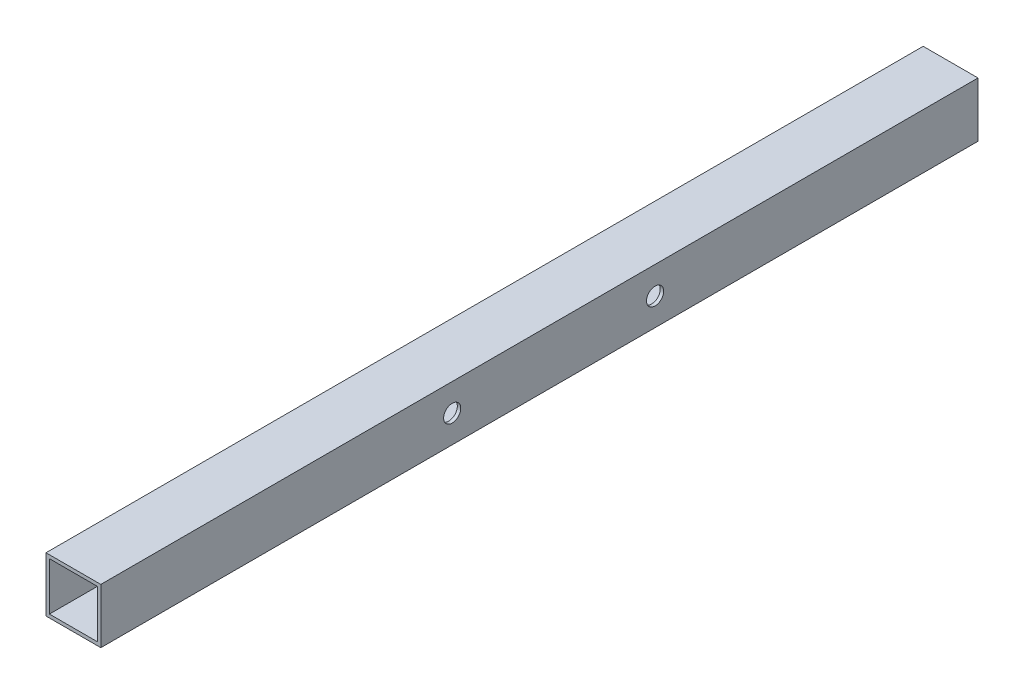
ISO-10303-21;
HEADER;
FILE_DESCRIPTION(('STEP AP214'),'2;1');
FILE_NAME('part.step','',(''),(''),'','','');
FILE_SCHEMA(('AUTOMOTIVE_DESIGN { 1 0 10303 214 1 1 1 1 }'));
ENDSEC;
DATA;
#1=APPLICATION_CONTEXT('core data for automotive mechanical design processes');
#2=APPLICATION_PROTOCOL_DEFINITION('international standard','automotive_design',2000,#1);
#3=PRODUCT_CONTEXT('',#1,'mechanical');
#4=PRODUCT('Part','Part','',(#3));
#5=PRODUCT_RELATED_PRODUCT_CATEGORY('part','',(#4));
#6=PRODUCT_DEFINITION_FORMATION('','',#4);
#7=PRODUCT_DEFINITION_CONTEXT('part definition',#1,'design');
#8=PRODUCT_DEFINITION('design','',#6,#7);
#9=PRODUCT_DEFINITION_SHAPE('','',#8);
#10=(LENGTH_UNIT() NAMED_UNIT(*) SI_UNIT(.MILLI.,.METRE.));
#11=(NAMED_UNIT(*) PLANE_ANGLE_UNIT() SI_UNIT($,.RADIAN.));
#12=(NAMED_UNIT(*) SI_UNIT($,.STERADIAN.) SOLID_ANGLE_UNIT());
#13=UNCERTAINTY_MEASURE_WITH_UNIT(LENGTH_MEASURE(1.E-05),#10,'distance_accuracy_value','');
#14=(GEOMETRIC_REPRESENTATION_CONTEXT(3) GLOBAL_UNCERTAINTY_ASSIGNED_CONTEXT((#13)) GLOBAL_UNIT_ASSIGNED_CONTEXT((#10,
#11,#12)) REPRESENTATION_CONTEXT('',''));
#15=CARTESIAN_POINT('',(0.,0.,0.));
#16=DIRECTION('',(0.,0.,1.));
#17=DIRECTION('',(1.,0.,0.));
#18=AXIS2_PLACEMENT_3D('',#15,#16,#17);
#19=CARTESIAN_POINT('',(-25.4000000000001,-25.4000000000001,-812.8));
#20=DIRECTION('',(-1.00000000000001,0.,0.));
#21=DIRECTION('',(0.,0.,1.));
#22=AXIS2_PLACEMENT_3D('',#19,#20,#21);
#23=PLANE('',#22);
#24=CARTESIAN_POINT('',(-25.4000000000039,0.,-513.588));
#25=DIRECTION('',(1.00000000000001,0.,0.));
#26=DIRECTION('',(0.,1.,0.));
#27=AXIS2_PLACEMENT_3D('',#24,#25,#26);
#28=CIRCLE('',#27,7.93750000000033);
#29=CARTESIAN_POINT('',(-25.4000000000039,7.93750000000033,-513.588));
#30=VERTEX_POINT('',#29);
#31=EDGE_CURVE('E197',#30,#30,#28,.T.);
#32=ORIENTED_EDGE('',*,*,#31,.T.);
#33=EDGE_LOOP('',(#32));
#34=FACE_BOUND('',#33,.T.);
#35=CARTESIAN_POINT('',(-25.4000000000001,0.,-325.5772));
#36=DIRECTION('',(1.00000000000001,0.,0.));
#37=DIRECTION('',(0.,1.,0.));
#38=AXIS2_PLACEMENT_3D('',#35,#36,#37);
#39=CIRCLE('',#38,7.93750000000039);
#40=CARTESIAN_POINT('',(-25.4000000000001,7.93750000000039,-325.5772));
#41=VERTEX_POINT('',#40);
#42=EDGE_CURVE('E180',#41,#41,#39,.T.);
#43=ORIENTED_EDGE('',*,*,#42,.T.);
#44=EDGE_LOOP('',(#43));
#45=FACE_BOUND('',#44,.T.);
#46=DIRECTION('',(0.,-1.,0.));
#47=VECTOR('',#46,1.);
#48=CARTESIAN_POINT('',(-25.4000000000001,-25.4000000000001,0.));
#49=LINE('',#48,#47);
#50=CARTESIAN_POINT('',(-25.4000000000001,25.4000000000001,0.));
#51=VERTEX_POINT('',#50);
#52=CARTESIAN_POINT('',(-25.4000000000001,-25.4000000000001,0.));
#53=VERTEX_POINT('',#52);
#54=EDGE_CURVE('E147',#51,#53,#49,.T.);
#55=ORIENTED_EDGE('',*,*,#54,.F.);
#56=DIRECTION('',(0.,0.,1.));
#57=VECTOR('',#56,1.);
#58=CARTESIAN_POINT('',(-25.4000000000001,25.3999999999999,-812.8));
#59=LINE('',#58,#57);
#60=CARTESIAN_POINT('',(-25.4000000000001,25.3999999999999,-812.8));
#61=VERTEX_POINT('',#60);
#62=EDGE_CURVE('E13',#61,#51,#59,.T.);
#63=ORIENTED_EDGE('',*,*,#62,.F.);
#64=DIRECTION('',(0.,-1.,0.));
#65=VECTOR('',#64,1.);
#66=CARTESIAN_POINT('',(-25.4000000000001,-25.4000000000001,-812.8));
#67=LINE('',#66,#65);
#68=CARTESIAN_POINT('',(-25.4000000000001,-25.4000000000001,-812.8));
#69=VERTEX_POINT('',#68);
#70=EDGE_CURVE('E151',#61,#69,#67,.T.);
#71=ORIENTED_EDGE('',*,*,#70,.T.);
#72=DIRECTION('',(0.,0.,1.));
#73=VECTOR('',#72,1.);
#74=CARTESIAN_POINT('',(-25.4000000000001,-25.4000000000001,-812.8));
#75=LINE('',#74,#73);
#76=EDGE_CURVE('E164',#69,#53,#75,.T.);
#77=ORIENTED_EDGE('',*,*,#76,.T.);
#78=EDGE_LOOP('',(#55,#63,#71,#77));
#79=FACE_BOUND('',#78,.T.);
#80=ADVANCED_FACE('F46',(#34,#45,#79),#23,.T.);
#81=CARTESIAN_POINT('',(-25.4000000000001,25.3999999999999,-812.8));
#82=DIRECTION('',(0.,1.,0.));
#83=DIRECTION('',(0.,0.,1.));
#84=AXIS2_PLACEMENT_3D('',#81,#82,#83);
#85=PLANE('',#84);
#86=DIRECTION('',(-1.00000000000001,0.,0.));
#87=VECTOR('',#86,1.);
#88=CARTESIAN_POINT('',(-25.4000000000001,25.4000000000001,0.));
#89=LINE('',#88,#87);
#90=CARTESIAN_POINT('',(25.4000000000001,25.4000000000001,-9.99200722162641E-13));
#91=VERTEX_POINT('',#90);
#92=EDGE_CURVE('E155',#91,#51,#89,.T.);
#93=ORIENTED_EDGE('',*,*,#92,.F.);
#94=DIRECTION('',(0.,0.,1.));
#95=VECTOR('',#94,1.);
#96=CARTESIAN_POINT('',(25.3999999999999,25.3999999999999,-812.800000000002));
#97=LINE('',#96,#95);
#98=CARTESIAN_POINT('',(25.3999999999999,25.3999999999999,-812.800000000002));
#99=VERTEX_POINT('',#98);
#100=EDGE_CURVE('E54',#99,#91,#97,.T.);
#101=ORIENTED_EDGE('',*,*,#100,.F.);
#102=DIRECTION('',(-1.00000000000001,0.,0.));
#103=VECTOR('',#102,1.);
#104=CARTESIAN_POINT('',(-25.4000000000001,25.3999999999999,-812.8));
#105=LINE('',#104,#103);
#106=EDGE_CURVE('E161',#99,#61,#105,.T.);
#107=ORIENTED_EDGE('',*,*,#106,.T.);
#108=ORIENTED_EDGE('',*,*,#62,.T.);
#109=EDGE_LOOP('',(#93,#101,#107,#108));
#110=FACE_BOUND('',#109,.T.);
#111=ADVANCED_FACE('F220',(#110),#85,.T.);
#112=CARTESIAN_POINT('',(25.3999999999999,-25.4000000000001,-812.8));
#113=DIRECTION('',(1.00000000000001,0.,0.));
#114=DIRECTION('',(0.,1.,0.));
#115=AXIS2_PLACEMENT_3D('',#112,#113,#114);
#116=PLANE('',#115);
#117=CARTESIAN_POINT('',(25.3999999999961,0.,-513.588));
#118=DIRECTION('',(1.00000000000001,0.,0.));
#119=DIRECTION('',(0.,1.,0.));
#120=AXIS2_PLACEMENT_3D('',#117,#118,#119);
#121=CIRCLE('',#120,7.93750000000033);
#122=CARTESIAN_POINT('',(25.3999999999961,7.93750000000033,-513.588));
#123=VERTEX_POINT('',#122);
#124=EDGE_CURVE('E194',#123,#123,#121,.T.);
#125=ORIENTED_EDGE('',*,*,#124,.F.);
#126=EDGE_LOOP('',(#125));
#127=FACE_BOUND('',#126,.T.);
#128=CARTESIAN_POINT('',(25.3999999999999,0.,-325.5772));
#129=DIRECTION('',(1.00000000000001,0.,0.));
#130=DIRECTION('',(0.,1.,0.));
#131=AXIS2_PLACEMENT_3D('',#128,#129,#130);
#132=CIRCLE('',#131,7.93750000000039);
#133=CARTESIAN_POINT('',(25.3999999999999,7.93750000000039,-325.5772));
#134=VERTEX_POINT('',#133);
#135=EDGE_CURVE('E185',#134,#134,#132,.T.);
#136=ORIENTED_EDGE('',*,*,#135,.F.);
#137=EDGE_LOOP('',(#136));
#138=FACE_BOUND('',#137,.T.);
#139=DIRECTION('',(0.,1.,0.));
#140=VECTOR('',#139,1.);
#141=CARTESIAN_POINT('',(25.4000000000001,-25.4000000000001,-9.99200722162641E-13));
#142=LINE('',#141,#140);
#143=CARTESIAN_POINT('',(25.4000000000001,-25.4000000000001,-9.99200722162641E-13));
#144=VERTEX_POINT('',#143);
#145=EDGE_CURVE('E170',#144,#91,#142,.T.);
#146=ORIENTED_EDGE('',*,*,#145,.F.);
#147=DIRECTION('',(0.,0.,1.));
#148=VECTOR('',#147,1.);
#149=CARTESIAN_POINT('',(25.3999999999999,-25.4000000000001,-812.8));
#150=LINE('',#149,#148);
#151=CARTESIAN_POINT('',(25.3999999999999,-25.4000000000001,-812.8));
#152=VERTEX_POINT('',#151);
#153=EDGE_CURVE('E176',#152,#144,#150,.T.);
#154=ORIENTED_EDGE('',*,*,#153,.F.);
#155=DIRECTION('',(0.,1.,0.));
#156=VECTOR('',#155,1.);
#157=CARTESIAN_POINT('',(25.3999999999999,-25.4000000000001,-812.8));
#158=LINE('',#157,#156);
#159=EDGE_CURVE('E158',#152,#99,#158,.T.);
#160=ORIENTED_EDGE('',*,*,#159,.T.);
#161=ORIENTED_EDGE('',*,*,#100,.T.);
#162=EDGE_LOOP('',(#146,#154,#160,#161));
#163=FACE_BOUND('',#162,.T.);
#164=ADVANCED_FACE('F224',(#127,#138,#163),#116,.T.);
#165=CARTESIAN_POINT('',(-25.4000000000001,-25.4000000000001,-812.8));
#166=DIRECTION('',(0.,-1.,0.));
#167=DIRECTION('',(0.,0.,-1.));
#168=AXIS2_PLACEMENT_3D('',#165,#166,#167);
#169=PLANE('',#168);
#170=DIRECTION('',(1.00000000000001,0.,0.));
#171=VECTOR('',#170,1.);
#172=CARTESIAN_POINT('',(-25.4000000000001,-25.4000000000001,0.));
#173=LINE('',#172,#171);
#174=EDGE_CURVE('E167',#53,#144,#173,.T.);
#175=ORIENTED_EDGE('',*,*,#174,.F.);
#176=ORIENTED_EDGE('',*,*,#76,.F.);
#177=DIRECTION('',(1.00000000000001,0.,0.));
#178=VECTOR('',#177,1.);
#179=CARTESIAN_POINT('',(-25.4000000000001,-25.4000000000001,-812.8));
#180=LINE('',#179,#178);
#181=EDGE_CURVE('E154',#69,#152,#180,.T.);
#182=ORIENTED_EDGE('',*,*,#181,.T.);
#183=ORIENTED_EDGE('',*,*,#153,.T.);
#184=EDGE_LOOP('',(#175,#176,#182,#183));
#185=FACE_BOUND('',#184,.T.);
#186=ADVANCED_FACE('F239',(#185),#169,.T.);
#187=CARTESIAN_POINT('',(0.,0.,-812.8));
#188=DIRECTION('',(0.,0.,-1.));
#189=DIRECTION('',(-1.00000000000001,0.,0.));
#190=AXIS2_PLACEMENT_3D('',#187,#188,#189);
#191=PLANE('',#190);
#192=DIRECTION('',(1.00000000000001,0.,0.));
#193=VECTOR('',#192,1.);
#194=CARTESIAN_POINT('',(-22.2249999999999,-22.2249999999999,-812.8));
#195=LINE('',#194,#193);
#196=CARTESIAN_POINT('',(-22.2249999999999,-22.2249999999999,-812.8));
#197=VERTEX_POINT('',#196);
#198=CARTESIAN_POINT('',(22.2249999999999,-22.2249999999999,-812.8));
#199=VERTEX_POINT('',#198);
#200=EDGE_CURVE('E113',#197,#199,#195,.T.);
#201=ORIENTED_EDGE('',*,*,#200,.T.);
#202=DIRECTION('',(0.,1.,0.));
#203=VECTOR('',#202,1.);
#204=CARTESIAN_POINT('',(22.2249999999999,-22.2249999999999,-812.8));
#205=LINE('',#204,#203);
#206=CARTESIAN_POINT('',(22.2249999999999,22.2249999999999,-812.8));
#207=VERTEX_POINT('',#206);
#208=EDGE_CURVE('E122',#199,#207,#205,.T.);
#209=ORIENTED_EDGE('',*,*,#208,.T.);
#210=DIRECTION('',(-1.00000000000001,0.,0.));
#211=VECTOR('',#210,1.);
#212=CARTESIAN_POINT('',(-22.2249999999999,22.2249999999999,-812.8));
#213=LINE('',#212,#211);
#214=CARTESIAN_POINT('',(-22.2249999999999,22.2249999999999,-812.8));
#215=VERTEX_POINT('',#214);
#216=EDGE_CURVE('E62',#207,#215,#213,.T.);
#217=ORIENTED_EDGE('',*,*,#216,.T.);
#218=DIRECTION('',(0.,-1.,0.));
#219=VECTOR('',#218,1.);
#220=CARTESIAN_POINT('',(-22.2249999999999,-22.2249999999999,-812.8));
#221=LINE('',#220,#219);
#222=EDGE_CURVE('E119',#215,#197,#221,.T.);
#223=ORIENTED_EDGE('',*,*,#222,.T.);
#224=EDGE_LOOP('',(#201,#209,#217,#223));
#225=FACE_BOUND('',#224,.T.);
#226=ORIENTED_EDGE('',*,*,#70,.F.);
#227=ORIENTED_EDGE('',*,*,#106,.F.);
#228=ORIENTED_EDGE('',*,*,#159,.F.);
#229=ORIENTED_EDGE('',*,*,#181,.F.);
#230=EDGE_LOOP('',(#226,#227,#228,#229));
#231=FACE_BOUND('',#230,.T.);
#232=ADVANCED_FACE('F126',(#225,#231),#191,.T.);
#233=CARTESIAN_POINT('',(0.,0.,0.));
#234=DIRECTION('',(0.,0.,-1.));
#235=DIRECTION('',(-1.00000000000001,0.,0.));
#236=AXIS2_PLACEMENT_3D('',#233,#234,#235);
#237=PLANE('',#236);
#238=DIRECTION('',(0.,1.,0.));
#239=VECTOR('',#238,1.);
#240=CARTESIAN_POINT('',(22.2249999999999,-22.2249999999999,0.));
#241=LINE('',#240,#239);
#242=CARTESIAN_POINT('',(22.2249999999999,-22.2249999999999,0.));
#243=VERTEX_POINT('',#242);
#244=CARTESIAN_POINT('',(22.2249999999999,22.2249999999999,0.));
#245=VERTEX_POINT('',#244);
#246=EDGE_CURVE('E141',#243,#245,#241,.T.);
#247=ORIENTED_EDGE('',*,*,#246,.F.);
#248=DIRECTION('',(1.00000000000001,0.,0.));
#249=VECTOR('',#248,1.);
#250=CARTESIAN_POINT('',(-22.2249999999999,-22.2249999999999,0.));
#251=LINE('',#250,#249);
#252=CARTESIAN_POINT('',(-22.2249999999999,-22.2249999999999,0.));
#253=VERTEX_POINT('',#252);
#254=EDGE_CURVE('E70',#253,#243,#251,.T.);
#255=ORIENTED_EDGE('',*,*,#254,.F.);
#256=DIRECTION('',(0.,-1.,0.));
#257=VECTOR('',#256,1.);
#258=CARTESIAN_POINT('',(-22.2249999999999,-22.2249999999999,0.));
#259=LINE('',#258,#257);
#260=CARTESIAN_POINT('',(-22.2249999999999,22.2249999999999,0.));
#261=VERTEX_POINT('',#260);
#262=EDGE_CURVE('E129',#261,#253,#259,.T.);
#263=ORIENTED_EDGE('',*,*,#262,.F.);
#264=DIRECTION('',(-1.00000000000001,0.,0.));
#265=VECTOR('',#264,1.);
#266=CARTESIAN_POINT('',(-22.2249999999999,22.2249999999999,0.));
#267=LINE('',#266,#265);
#268=EDGE_CURVE('E132',#245,#261,#267,.T.);
#269=ORIENTED_EDGE('',*,*,#268,.F.);
#270=EDGE_LOOP('',(#247,#255,#263,#269));
#271=FACE_BOUND('',#270,.T.);
#272=ORIENTED_EDGE('',*,*,#54,.T.);
#273=ORIENTED_EDGE('',*,*,#174,.T.);
#274=ORIENTED_EDGE('',*,*,#145,.T.);
#275=ORIENTED_EDGE('',*,*,#92,.T.);
#276=EDGE_LOOP('',(#272,#273,#274,#275));
#277=FACE_BOUND('',#276,.T.);
#278=ADVANCED_FACE('F233',(#271,#277),#237,.F.);
#279=CARTESIAN_POINT('',(-22.2249999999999,-22.2249999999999,-812.8));
#280=DIRECTION('',(0.,-1.,0.));
#281=DIRECTION('',(0.,0.,-1.));
#282=AXIS2_PLACEMENT_3D('',#279,#280,#281);
#283=PLANE('',#282);
#284=ORIENTED_EDGE('',*,*,#254,.T.);
#285=DIRECTION('',(0.,0.,1.));
#286=VECTOR('',#285,1.);
#287=CARTESIAN_POINT('',(22.2249999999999,-22.2249999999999,-812.8));
#288=LINE('',#287,#286);
#289=EDGE_CURVE('E109',#199,#243,#288,.T.);
#290=ORIENTED_EDGE('',*,*,#289,.F.);
#291=ORIENTED_EDGE('',*,*,#200,.F.);
#292=DIRECTION('',(0.,0.,1.));
#293=VECTOR('',#292,1.);
#294=CARTESIAN_POINT('',(-22.2249999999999,-22.2249999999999,-812.8));
#295=LINE('',#294,#293);
#296=EDGE_CURVE('E145',#197,#253,#295,.T.);
#297=ORIENTED_EDGE('',*,*,#296,.T.);
#298=EDGE_LOOP('',(#284,#290,#291,#297));
#299=FACE_BOUND('',#298,.T.);
#300=ADVANCED_FACE('F111',(#299),#283,.F.);
#301=CARTESIAN_POINT('',(-22.2249999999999,-22.2249999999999,-812.8));
#302=DIRECTION('',(-1.00000000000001,0.,0.));
#303=DIRECTION('',(0.,0.,1.));
#304=AXIS2_PLACEMENT_3D('',#301,#302,#303);
#305=PLANE('',#304);
#306=CARTESIAN_POINT('',(-22.2250000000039,0.,-513.588));
#307=DIRECTION('',(-1.00000000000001,0.,0.));
#308=DIRECTION('',(0.,0.,1.));
#309=AXIS2_PLACEMENT_3D('',#306,#307,#308);
#310=CIRCLE('',#309,7.93750000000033);
#311=CARTESIAN_POINT('',(-22.2250000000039,0.,-505.6505));
#312=VERTEX_POINT('',#311);
#313=EDGE_CURVE('E190',#312,#312,#310,.T.);
#314=ORIENTED_EDGE('',*,*,#313,.T.);
#315=EDGE_LOOP('',(#314));
#316=FACE_BOUND('',#315,.T.);
#317=CARTESIAN_POINT('',(-22.2250000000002,0.,-325.5772));
#318=DIRECTION('',(-1.00000000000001,0.,0.));
#319=DIRECTION('',(0.,0.,1.));
#320=AXIS2_PLACEMENT_3D('',#317,#318,#319);
#321=CIRCLE('',#320,7.93750000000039);
#322=CARTESIAN_POINT('',(-22.2250000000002,0.,-317.6397));
#323=VERTEX_POINT('',#322);
#324=EDGE_CURVE('E135',#323,#323,#321,.T.);
#325=ORIENTED_EDGE('',*,*,#324,.T.);
#326=EDGE_LOOP('',(#325));
#327=FACE_BOUND('',#326,.T.);
#328=ORIENTED_EDGE('',*,*,#262,.T.);
#329=ORIENTED_EDGE('',*,*,#296,.F.);
#330=ORIENTED_EDGE('',*,*,#222,.F.);
#331=DIRECTION('',(0.,0.,1.));
#332=VECTOR('',#331,1.);
#333=CARTESIAN_POINT('',(-22.2249999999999,22.2249999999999,-812.8));
#334=LINE('',#333,#332);
#335=EDGE_CURVE('E148',#215,#261,#334,.T.);
#336=ORIENTED_EDGE('',*,*,#335,.T.);
#337=EDGE_LOOP('',(#328,#329,#330,#336));
#338=FACE_BOUND('',#337,.T.);
#339=ADVANCED_FACE('F257',(#316,#327,#338),#305,.F.);
#340=CARTESIAN_POINT('',(-22.2249999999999,22.2249999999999,-812.8));
#341=DIRECTION('',(0.,1.,0.));
#342=DIRECTION('',(-1.00000000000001,0.,0.));
#343=AXIS2_PLACEMENT_3D('',#340,#341,#342);
#344=PLANE('',#343);
#345=ORIENTED_EDGE('',*,*,#268,.T.);
#346=ORIENTED_EDGE('',*,*,#335,.F.);
#347=ORIENTED_EDGE('',*,*,#216,.F.);
#348=DIRECTION('',(0.,0.,1.));
#349=VECTOR('',#348,1.);
#350=CARTESIAN_POINT('',(22.2249999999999,22.2249999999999,-812.8));
#351=LINE('',#350,#349);
#352=EDGE_CURVE('E118',#207,#245,#351,.T.);
#353=ORIENTED_EDGE('',*,*,#352,.T.);
#354=EDGE_LOOP('',(#345,#346,#347,#353));
#355=FACE_BOUND('',#354,.T.);
#356=ADVANCED_FACE('F260',(#355),#344,.F.);
#357=CARTESIAN_POINT('',(22.2249999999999,-22.2249999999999,-812.8));
#358=DIRECTION('',(1.00000000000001,0.,0.));
#359=DIRECTION('',(0.,0.,-1.));
#360=AXIS2_PLACEMENT_3D('',#357,#358,#359);
#361=PLANE('',#360);
#362=CARTESIAN_POINT('',(22.2249999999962,0.,-513.588));
#363=DIRECTION('',(1.00000000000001,0.,0.));
#364=DIRECTION('',(0.,0.,-1.));
#365=AXIS2_PLACEMENT_3D('',#362,#363,#364);
#366=CIRCLE('',#365,7.93750000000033);
#367=CARTESIAN_POINT('',(22.2249999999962,0.,-521.5255));
#368=VERTEX_POINT('',#367);
#369=EDGE_CURVE('E49',#368,#368,#366,.T.);
#370=ORIENTED_EDGE('',*,*,#369,.T.);
#371=EDGE_LOOP('',(#370));
#372=FACE_BOUND('',#371,.T.);
#373=CARTESIAN_POINT('',(22.2249999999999,0.,-325.5772));
#374=DIRECTION('',(1.00000000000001,0.,0.));
#375=DIRECTION('',(0.,0.,-1.));
#376=AXIS2_PLACEMENT_3D('',#373,#374,#375);
#377=CIRCLE('',#376,7.93750000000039);
#378=CARTESIAN_POINT('',(22.2249999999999,0.,-333.5147));
#379=VERTEX_POINT('',#378);
#380=EDGE_CURVE('E178',#379,#379,#377,.T.);
#381=ORIENTED_EDGE('',*,*,#380,.T.);
#382=EDGE_LOOP('',(#381));
#383=FACE_BOUND('',#382,.T.);
#384=ORIENTED_EDGE('',*,*,#246,.T.);
#385=ORIENTED_EDGE('',*,*,#352,.F.);
#386=ORIENTED_EDGE('',*,*,#208,.F.);
#387=ORIENTED_EDGE('',*,*,#289,.T.);
#388=EDGE_LOOP('',(#384,#385,#386,#387));
#389=FACE_BOUND('',#388,.T.);
#390=ADVANCED_FACE('F123',(#372,#383,#389),#361,.F.);
#391=CARTESIAN_POINT('',(-25.4000000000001,0.,-325.5772));
#392=DIRECTION('',(1.00000000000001,0.,0.));
#393=DIRECTION('',(0.,1.,0.));
#394=AXIS2_PLACEMENT_3D('',#391,#392,#393);
#395=CYLINDRICAL_SURFACE('',#394,7.93750000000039);
#396=ORIENTED_EDGE('',*,*,#135,.T.);
#397=EDGE_LOOP('',(#396));
#398=FACE_BOUND('',#397,.T.);
#399=ORIENTED_EDGE('',*,*,#380,.F.);
#400=EDGE_LOOP('',(#399));
#401=FACE_BOUND('',#400,.T.);
#402=ADVANCED_FACE('F216',(#398,#401),#395,.F.);
#403=ORIENTED_EDGE('',*,*,#42,.F.);
#404=EDGE_LOOP('',(#403));
#405=FACE_BOUND('',#404,.T.);
#406=ORIENTED_EDGE('',*,*,#324,.F.);
#407=EDGE_LOOP('',(#406));
#408=FACE_BOUND('',#407,.T.);
#409=ADVANCED_FACE('F208',(#405,#408),#395,.F.);
#410=CARTESIAN_POINT('',(-25.4000000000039,0.,-513.588));
#411=DIRECTION('',(1.00000000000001,0.,0.));
#412=DIRECTION('',(0.,1.,0.));
#413=AXIS2_PLACEMENT_3D('',#410,#411,#412);
#414=CYLINDRICAL_SURFACE('',#413,7.93750000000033);
#415=ORIENTED_EDGE('',*,*,#124,.T.);
#416=EDGE_LOOP('',(#415));
#417=FACE_BOUND('',#416,.T.);
#418=ORIENTED_EDGE('',*,*,#369,.F.);
#419=EDGE_LOOP('',(#418));
#420=FACE_BOUND('',#419,.T.);
#421=ADVANCED_FACE('F205',(#417,#420),#414,.F.);
#422=ORIENTED_EDGE('',*,*,#31,.F.);
#423=EDGE_LOOP('',(#422));
#424=FACE_BOUND('',#423,.T.);
#425=ORIENTED_EDGE('',*,*,#313,.F.);
#426=EDGE_LOOP('',(#425));
#427=FACE_BOUND('',#426,.T.);
#428=ADVANCED_FACE('F207',(#424,#427),#414,.F.);
#429=CLOSED_SHELL('',(#80,#111,#164,#186,#232,#278,#300,#339,#356,#390,#402,#409,#421,#428));
#430=MANIFOLD_SOLID_BREP('B2',#429);
#431=ADVANCED_BREP_SHAPE_REPRESENTATION('',(#18,#430),#14);
#432=SHAPE_DEFINITION_REPRESENTATION(#9,#431);
ENDSEC;
END-ISO-10303-21;
